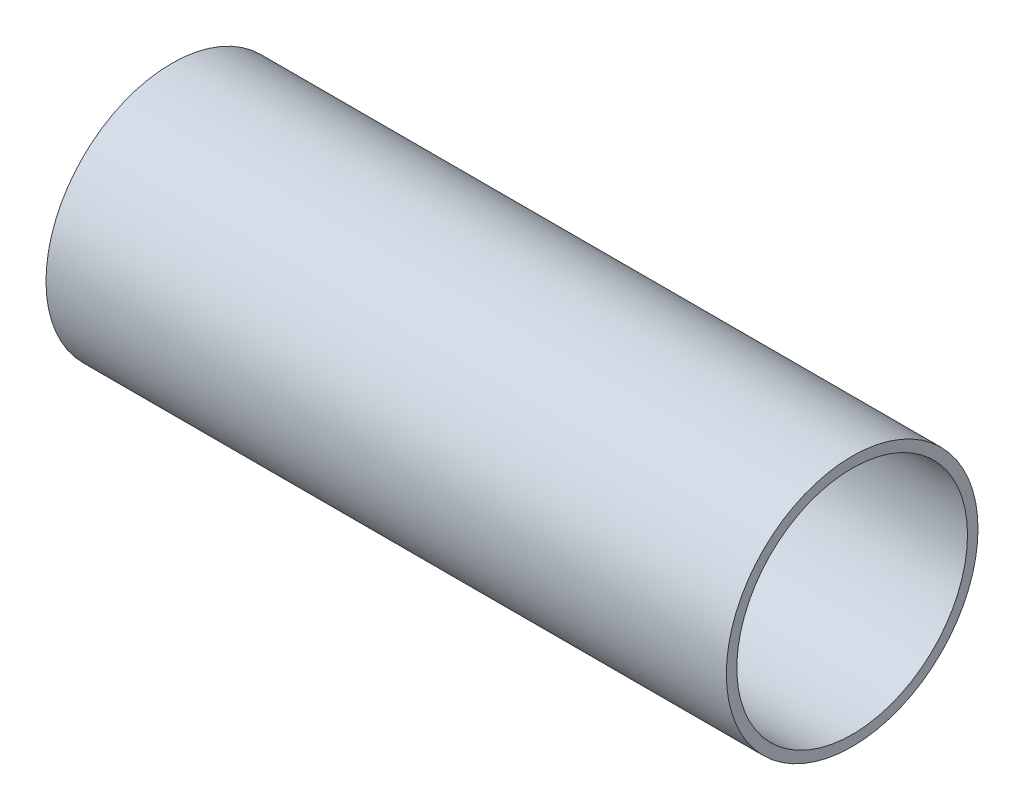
from build123d import *

# Parameters (mm, degrees)
SKETCH1_R           = 76.2
SKETCH1_R_2         = 69.85
BOSS_EXTRUDE1_DEPTH = 206


with BuildPart() as part:
    # Sketch1 → Boss-Extrude1 (new, symmetric)
    with BuildSketch(Plane(origin=(0, 0, 0), x_dir=(0, 0, -1), z_dir=(1, 0, 0))):
        Circle(SKETCH1_R)
        Circle(SKETCH1_R_2, mode=Mode.SUBTRACT)
    extrude(amount=BOSS_EXTRUDE1_DEPTH, both=True)


solid = part.part
